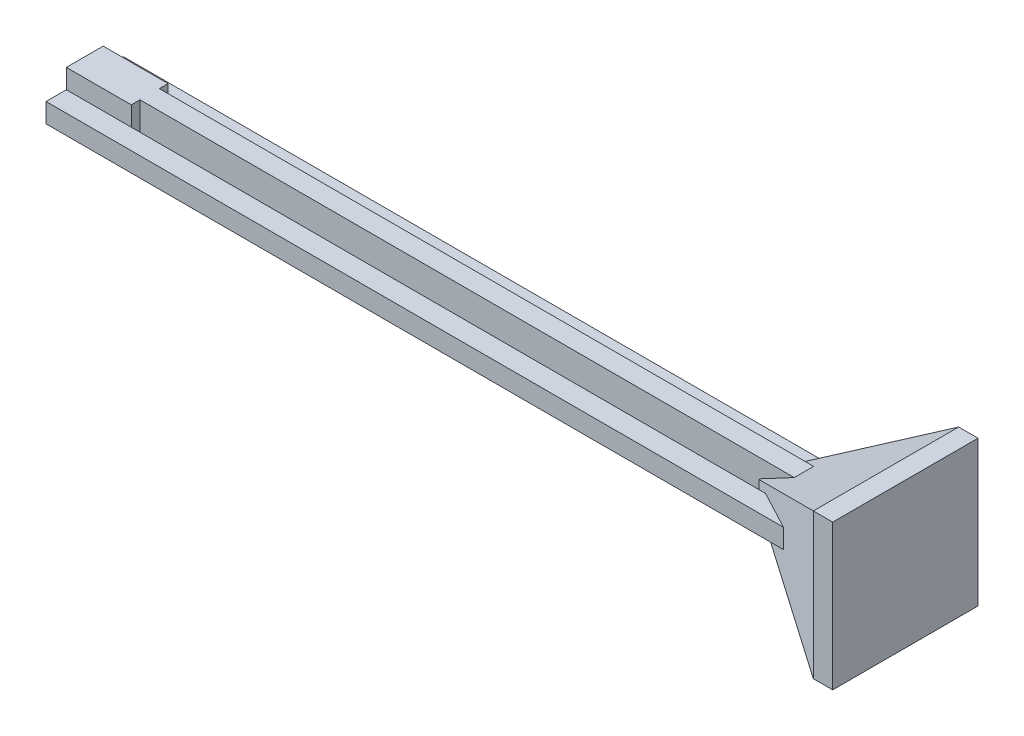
from build123d import *

# Parameters (mm, degrees)
ESQUISSE1_W        = 6.7
ESQUISSE1_H        = 3.8
ESQUISSE1_W_2      = 4.3
ESQUISSE1_H_2      = 1.4
BOSS_EXTRU_1_DEPTH = 4
ESQUISSE2_W        = 3.8
ESQUISSE2_H        = 2
BOSS_EXTRU_2_DEPTH = 6.7
ESQUISSE3_W        = 2
ESQUISSE3_H        = 6
BOSS_EXTRU_3_DEPTH = 76
ESQUISSE4_W        = 15
ESQUISSE4_H        = 15
BOSS_EXTRU_4_DEPTH = 12
BOSS_EXTRU_4_DRAFT = -28
ESQUISSE5_W        = 2.1
ESQUISSE5_H        = 2
BOSS_EXTRU_5_DEPTH = 78
ESQUISSE6_W        = 15
ESQUISSE6_H        = 15
BOSS_EXTRU_6_DEPTH = 2


with BuildPart() as part:
    # Esquisse1 → Boss.-Extru.1 (new body)
    with BuildSketch(Plane(origin=(0, 0, 0), x_dir=(1, 0, 0), z_dir=(0, 1, 0))):
        Rectangle(ESQUISSE1_W, ESQUISSE1_H)
        Rectangle(ESQUISSE1_W_2, ESQUISSE1_H_2, mode=Mode.SUBTRACT)
    extrude(amount=BOSS_EXTRU_1_DEPTH)

    # Esquisse2 → Boss.-Extru.2 (add)
    with BuildSketch(Plane(origin=(3.35, 0, 0), x_dir=(0, 0, -1), z_dir=(1, 0, 0))):
        with Locations((0, 5)):
            Rectangle(ESQUISSE2_W, ESQUISSE2_H)
    extrude(amount=-BOSS_EXTRU_2_DEPTH)

    # Esquisse3 → Boss.-Extru.3 (add)
    with BuildSketch(Plane(origin=(3.35, 0, 0), x_dir=(0, 0, -1), z_dir=(1, 0, 0))):
        with Locations((0, 3)):
            Rectangle(ESQUISSE3_W, ESQUISSE3_H)
    extrude(amount=BOSS_EXTRU_3_DEPTH)


with BuildPart() as boss_extru_4_tool:
    # Esquisse4 → Boss.-Extru.4 (with draft: the straight prism first)
    with BuildSketch(Plane(origin=(79.35, 0, 0), x_dir=(0, 0, -1), z_dir=(1, 0, 0))):
        with Locations((0, 3)):
            Rectangle(ESQUISSE4_W, ESQUISSE4_H)
    extrude(amount=-BOSS_EXTRU_4_DEPTH)
    # Boss.-Extru.4: the draft: its side faces are tilted about the plane it starts from
    boss_extru_4_sides = [boss_extru_4_tool.faces().sort_by_distance(p)[0] for p in [
        (73.35, 3, 7.5),
        (73.35, -4.5, 0),
        (73.35, 3, -7.5),
        (73.35, 10.5, 0),
    ]]
    draft(boss_extru_4_sides, Plane(origin=(79.35, 0, 0), x_dir=(0, 0, -1), z_dir=(1, 0, 0)), BOSS_EXTRU_4_DRAFT)


with BuildPart() as part_1:
    add(part.part)

    # Boss.-Extru.4: add boss_extru_4_tool
    add(boss_extru_4_tool.part)

    # Esquisse5 → Boss.-Extru.5 (add)
    with BuildSketch(Plane.ZY.offset(3.35)):
        with Locations((-2.95, 3)):
            Rectangle(ESQUISSE5_W, ESQUISSE5_H)
        with Locations((2.95, 3)):
            Rectangle(ESQUISSE5_W, ESQUISSE5_H)
    extrude(amount=-BOSS_EXTRU_5_DEPTH)

    # Esquisse6 → Boss.-Extru.6 (add)
    with BuildSketch(Plane(origin=(79.35, 0, 0), x_dir=(0, 0, -1), z_dir=(1, 0, 0))):
        with Locations((0, 3)):
            Rectangle(ESQUISSE6_W, ESQUISSE6_H)
    extrude(amount=BOSS_EXTRU_6_DEPTH)


solid = part_1.part
